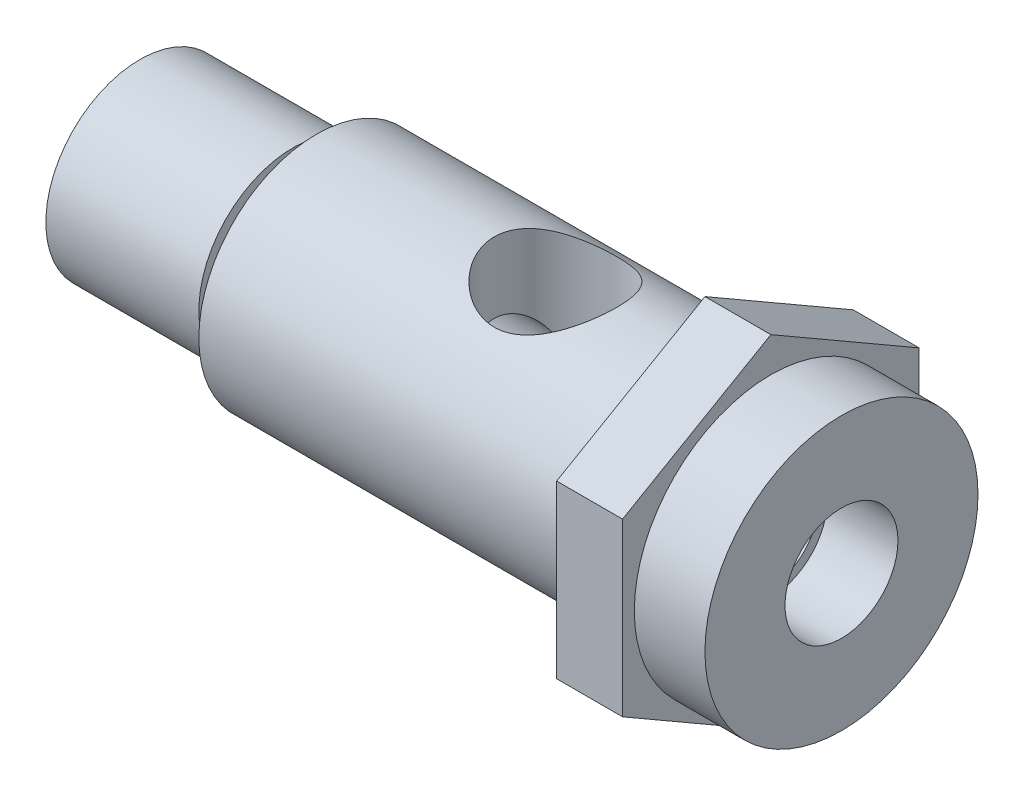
ISO-10303-21;
HEADER;
FILE_DESCRIPTION(('STEP AP214'),'2;1');
FILE_NAME('part.step','',(''),(''),'','','');
FILE_SCHEMA(('AUTOMOTIVE_DESIGN { 1 0 10303 214 1 1 1 1 }'));
ENDSEC;
DATA;
#1=APPLICATION_CONTEXT('core data for automotive mechanical design processes');
#2=APPLICATION_PROTOCOL_DEFINITION('international standard','automotive_design',2000,#1);
#3=PRODUCT_CONTEXT('',#1,'mechanical');
#4=PRODUCT('Part','Part','',(#3));
#5=PRODUCT_RELATED_PRODUCT_CATEGORY('part','',(#4));
#6=PRODUCT_DEFINITION_FORMATION('','',#4);
#7=PRODUCT_DEFINITION_CONTEXT('part definition',#1,'design');
#8=PRODUCT_DEFINITION('design','',#6,#7);
#9=PRODUCT_DEFINITION_SHAPE('','',#8);
#10=(LENGTH_UNIT() NAMED_UNIT(*) SI_UNIT(.MILLI.,.METRE.));
#11=(NAMED_UNIT(*) PLANE_ANGLE_UNIT() SI_UNIT($,.RADIAN.));
#12=(NAMED_UNIT(*) SI_UNIT($,.STERADIAN.) SOLID_ANGLE_UNIT());
#13=UNCERTAINTY_MEASURE_WITH_UNIT(LENGTH_MEASURE(1.E-05),#10,'distance_accuracy_value','');
#14=(GEOMETRIC_REPRESENTATION_CONTEXT(3) GLOBAL_UNCERTAINTY_ASSIGNED_CONTEXT((#13)) GLOBAL_UNIT_ASSIGNED_CONTEXT((#10,
#11,#12)) REPRESENTATION_CONTEXT('',''));
#15=CARTESIAN_POINT('',(0.,0.,0.));
#16=DIRECTION('',(0.,0.,1.));
#17=DIRECTION('',(1.,0.,0.));
#18=AXIS2_PLACEMENT_3D('',#15,#16,#17);
#19=CARTESIAN_POINT('',(18.923,0.6696363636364,0.));
#20=DIRECTION('',(1.,0.,0.));
#21=DIRECTION('',(0.,0.,-1.));
#22=AXIS2_PLACEMENT_3D('',#19,#20,#21);
#23=PLANE('',#22);
#24=CARTESIAN_POINT('',(18.9229999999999,0.,0.));
#25=DIRECTION('',(1.,0.,0.));
#26=DIRECTION('',(0.,0.,-1.));
#27=AXIS2_PLACEMENT_3D('',#24,#25,#26);
#28=CIRCLE('',#27,3.048);
#29=CARTESIAN_POINT('',(18.9229999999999,0.,-3.04800000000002));
#30=VERTEX_POINT('',#29);
#31=EDGE_CURVE('E422',#30,#30,#28,.F.);
#32=ORIENTED_EDGE('',*,*,#31,.T.);
#33=EDGE_LOOP('',(#32));
#34=FACE_BOUND('',#33,.T.);
#35=CARTESIAN_POINT('',(18.9229999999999,0.,0.));
#36=DIRECTION('',(1.,0.,0.));
#37=DIRECTION('',(0.,0.,-1.));
#38=AXIS2_PLACEMENT_3D('',#35,#36,#37);
#39=CIRCLE('',#38,7.366);
#40=CARTESIAN_POINT('',(18.9229999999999,0.,-7.36600000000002));
#41=VERTEX_POINT('',#40);
#42=EDGE_CURVE('E22',#41,#41,#39,.F.);
#43=ORIENTED_EDGE('',*,*,#42,.F.);
#44=EDGE_LOOP('',(#43));
#45=FACE_BOUND('',#44,.T.);
#46=ADVANCED_FACE('F17',(#34,#45),#23,.T.);
#47=CARTESIAN_POINT('',(-18.923,0.461818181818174,0.));
#48=DIRECTION('',(1.,0.,0.));
#49=DIRECTION('',(0.,0.,-1.));
#50=AXIS2_PLACEMENT_3D('',#47,#48,#49);
#51=PLANE('',#50);
#52=CARTESIAN_POINT('',(-18.923,0.,0.));
#53=DIRECTION('',(1.,0.,0.));
#54=DIRECTION('',(0.,0.,-1.));
#55=AXIS2_PLACEMENT_3D('',#52,#53,#54);
#56=CIRCLE('',#55,3.048);
#57=CARTESIAN_POINT('',(-18.923,0.,-3.04800000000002));
#58=VERTEX_POINT('',#57);
#59=EDGE_CURVE('E425',#58,#58,#56,.T.);
#60=ORIENTED_EDGE('',*,*,#59,.T.);
#61=EDGE_LOOP('',(#60));
#62=FACE_BOUND('',#61,.T.);
#63=CARTESIAN_POINT('',(-18.923,0.,0.));
#64=DIRECTION('',(1.,0.,0.));
#65=DIRECTION('',(0.,0.,-1.));
#66=AXIS2_PLACEMENT_3D('',#63,#64,#65);
#67=CIRCLE('',#66,5.08);
#68=CARTESIAN_POINT('',(-18.923,0.,-5.08000000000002));
#69=VERTEX_POINT('',#68);
#70=EDGE_CURVE('E428',#69,#69,#67,.T.);
#71=ORIENTED_EDGE('',*,*,#70,.F.);
#72=EDGE_LOOP('',(#71));
#73=FACE_BOUND('',#72,.T.);
#74=ADVANCED_FACE('F387',(#62,#73),#51,.F.);
#75=CARTESIAN_POINT('',(15.113,0.,0.));
#76=DIRECTION('',(1.,0.,0.));
#77=DIRECTION('',(0.,0.,-1.));
#78=AXIS2_PLACEMENT_3D('',#75,#76,#77);
#79=CYLINDRICAL_SURFACE('',#78,7.366);
#80=ORIENTED_EDGE('',*,*,#42,.T.);
#81=EDGE_LOOP('',(#80));
#82=FACE_BOUND('',#81,.T.);
#83=CARTESIAN_POINT('',(15.113,0.,0.));
#84=DIRECTION('',(1.,0.,0.));
#85=DIRECTION('',(0.,0.,-1.));
#86=AXIS2_PLACEMENT_3D('',#83,#84,#85);
#87=CIRCLE('',#86,7.366);
#88=CARTESIAN_POINT('',(15.113,0.,-7.36600000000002));
#89=VERTEX_POINT('',#88);
#90=EDGE_CURVE('E433',#89,#89,#87,.F.);
#91=ORIENTED_EDGE('',*,*,#90,.F.);
#92=EDGE_LOOP('',(#91));
#93=FACE_BOUND('',#92,.T.);
#94=ADVANCED_FACE('F378',(#82,#93),#79,.T.);
#95=CARTESIAN_POINT('',(-18.923,0.,0.));
#96=DIRECTION('',(1.,0.,0.));
#97=DIRECTION('',(0.,0.,-1.));
#98=AXIS2_PLACEMENT_3D('',#95,#96,#97);
#99=CYLINDRICAL_SURFACE('',#98,3.048);
#100=ORIENTED_EDGE('',*,*,#59,.F.);
#101=EDGE_LOOP('',(#100));
#102=FACE_BOUND('',#101,.T.);
#103=CARTESIAN_POINT('',(-16.383,0.,0.));
#104=DIRECTION('',(1.,0.,0.));
#105=DIRECTION('',(0.,0.,-1.));
#106=AXIS2_PLACEMENT_3D('',#103,#104,#105);
#107=CIRCLE('',#106,3.048);
#108=CARTESIAN_POINT('',(-16.383,0.,-3.04800000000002));
#109=VERTEX_POINT('',#108);
#110=EDGE_CURVE('E436',#109,#109,#107,.T.);
#111=ORIENTED_EDGE('',*,*,#110,.T.);
#112=EDGE_LOOP('',(#111));
#113=FACE_BOUND('',#112,.T.);
#114=ADVANCED_FACE('F369',(#102,#113),#99,.F.);
#115=CARTESIAN_POINT('',(15.113,0.,0.));
#116=DIRECTION('',(1.,0.,0.));
#117=DIRECTION('',(0.,0.,-1.));
#118=AXIS2_PLACEMENT_3D('',#115,#116,#117);
#119=CYLINDRICAL_SURFACE('',#118,3.048);
#120=CARTESIAN_POINT('',(15.113,0.,0.));
#121=DIRECTION('',(1.,0.,0.));
#122=DIRECTION('',(0.,0.,-1.));
#123=AXIS2_PLACEMENT_3D('',#120,#121,#122);
#124=CIRCLE('',#123,3.048);
#125=CARTESIAN_POINT('',(15.113,0.,-3.04800000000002));
#126=VERTEX_POINT('',#125);
#127=EDGE_CURVE('E439',#126,#126,#124,.T.);
#128=ORIENTED_EDGE('',*,*,#127,.F.);
#129=EDGE_LOOP('',(#128));
#130=FACE_BOUND('',#129,.T.);
#131=ORIENTED_EDGE('',*,*,#31,.F.);
#132=EDGE_LOOP('',(#131));
#133=FACE_BOUND('',#132,.T.);
#134=ADVANCED_FACE('F360',(#130,#133),#119,.F.);
#135=CARTESIAN_POINT('',(-18.923,0.,0.));
#136=DIRECTION('',(1.,0.,0.));
#137=DIRECTION('',(0.,0.,-1.));
#138=AXIS2_PLACEMENT_3D('',#135,#136,#137);
#139=CYLINDRICAL_SURFACE('',#138,5.08);
#140=ORIENTED_EDGE('',*,*,#70,.T.);
#141=EDGE_LOOP('',(#140));
#142=FACE_BOUND('',#141,.T.);
#143=CARTESIAN_POINT('',(-10.668,0.,0.));
#144=DIRECTION('',(1.,0.,0.));
#145=DIRECTION('',(0.,0.,-1.));
#146=AXIS2_PLACEMENT_3D('',#143,#144,#145);
#147=CIRCLE('',#146,5.08);
#148=CARTESIAN_POINT('',(-10.668,0.,-5.08000000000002));
#149=VERTEX_POINT('',#148);
#150=EDGE_CURVE('E109',#149,#149,#147,.T.);
#151=ORIENTED_EDGE('',*,*,#150,.F.);
#152=EDGE_LOOP('',(#151));
#153=FACE_BOUND('',#152,.T.);
#154=ADVANCED_FACE('F351',(#142,#153),#139,.T.);
#155=CARTESIAN_POINT('',(15.113,0.,0.));
#156=DIRECTION('',(1.,0.,0.));
#157=DIRECTION('',(0.,0.,-1.));
#158=AXIS2_PLACEMENT_3D('',#155,#156,#157);
#159=PLANE('',#158);
#160=ORIENTED_EDGE('',*,*,#90,.T.);
#161=EDGE_LOOP('',(#160));
#162=FACE_BOUND('',#161,.T.);
#163=DIRECTION('',(0.,-0.499999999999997,0.86602540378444));
#164=VECTOR('',#163,1.);
#165=CARTESIAN_POINT('',(15.113,9.23875900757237,0.));
#166=LINE('',#165,#164);
#167=CARTESIAN_POINT('',(15.113,4.61937950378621,8.00100000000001));
#168=VERTEX_POINT('',#167);
#169=CARTESIAN_POINT('',(15.113,9.23875900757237,0.));
#170=VERTEX_POINT('',#169);
#171=EDGE_CURVE('E118',#168,#170,#166,.F.);
#172=ORIENTED_EDGE('',*,*,#171,.F.);
#173=DIRECTION('',(0.,1.,0.));
#174=VECTOR('',#173,1.);
#175=CARTESIAN_POINT('',(15.113,4.61937950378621,8.00100000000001));
#176=LINE('',#175,#174);
#177=CARTESIAN_POINT('',(15.113,-4.61937950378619,8.00100000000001));
#178=VERTEX_POINT('',#177);
#179=EDGE_CURVE('E127',#178,#168,#176,.T.);
#180=ORIENTED_EDGE('',*,*,#179,.F.);
#181=DIRECTION('',(0.,-0.499999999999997,-0.86602540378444));
#182=VECTOR('',#181,1.);
#183=CARTESIAN_POINT('',(15.113,-4.61937950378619,8.00100000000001));
#184=LINE('',#183,#182);
#185=CARTESIAN_POINT('',(15.113,-9.23875900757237,0.));
#186=VERTEX_POINT('',#185);
#187=EDGE_CURVE('E89',#186,#178,#184,.F.);
#188=ORIENTED_EDGE('',*,*,#187,.F.);
#189=DIRECTION('',(0.,0.499999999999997,-0.86602540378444));
#190=VECTOR('',#189,1.);
#191=CARTESIAN_POINT('',(15.113,-9.23875900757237,0.));
#192=LINE('',#191,#190);
#193=CARTESIAN_POINT('',(15.113,-4.61937950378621,-8.00100000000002));
#194=VERTEX_POINT('',#193);
#195=EDGE_CURVE('E108',#194,#186,#192,.F.);
#196=ORIENTED_EDGE('',*,*,#195,.F.);
#197=DIRECTION('',(0.,1.,0.));
#198=VECTOR('',#197,1.);
#199=CARTESIAN_POINT('',(15.113,-4.61937950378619,-8.001));
#200=LINE('',#199,#198);
#201=CARTESIAN_POINT('',(15.113,4.61937950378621,-8.00100000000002));
#202=VERTEX_POINT('',#201);
#203=EDGE_CURVE('E101',#202,#194,#200,.F.);
#204=ORIENTED_EDGE('',*,*,#203,.F.);
#205=DIRECTION('',(0.,0.499999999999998,0.86602540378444));
#206=VECTOR('',#205,1.);
#207=CARTESIAN_POINT('',(15.113,4.61937950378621,-8.00100000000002));
#208=LINE('',#207,#206);
#209=EDGE_CURVE('E105',#170,#202,#208,.F.);
#210=ORIENTED_EDGE('',*,*,#209,.F.);
#211=EDGE_LOOP('',(#172,#180,#188,#196,#204,#210));
#212=FACE_BOUND('',#211,.T.);
#213=ADVANCED_FACE('F103',(#162,#212),#159,.T.);
#214=CARTESIAN_POINT('',(-16.383,0.277090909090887,0.));
#215=DIRECTION('',(1.,0.,0.));
#216=DIRECTION('',(0.,0.,-1.));
#217=AXIS2_PLACEMENT_3D('',#214,#215,#216);
#218=PLANE('',#217);
#219=CARTESIAN_POINT('',(-16.383,0.,0.));
#220=DIRECTION('',(1.,0.,0.));
#221=DIRECTION('',(0.,0.,-1.));
#222=AXIS2_PLACEMENT_3D('',#219,#220,#221);
#223=CIRCLE('',#222,2.54);
#224=CARTESIAN_POINT('',(-16.383,0.,-2.54000000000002));
#225=VERTEX_POINT('',#224);
#226=EDGE_CURVE('E160',#225,#225,#223,.T.);
#227=ORIENTED_EDGE('',*,*,#226,.T.);
#228=EDGE_LOOP('',(#227));
#229=FACE_BOUND('',#228,.T.);
#230=ORIENTED_EDGE('',*,*,#110,.F.);
#231=EDGE_LOOP('',(#230));
#232=FACE_BOUND('',#231,.T.);
#233=ADVANCED_FACE('F334',(#229,#232),#218,.F.);
#234=CARTESIAN_POINT('',(15.113,0.,0.));
#235=DIRECTION('',(1.,0.,0.));
#236=DIRECTION('',(0.,0.,-1.));
#237=AXIS2_PLACEMENT_3D('',#234,#235,#236);
#238=PLANE('',#237);
#239=CARTESIAN_POINT('',(15.113,0.,0.));
#240=DIRECTION('',(1.,0.,0.));
#241=DIRECTION('',(0.,0.,-1.));
#242=AXIS2_PLACEMENT_3D('',#239,#240,#241);
#243=CIRCLE('',#242,2.54);
#244=CARTESIAN_POINT('',(15.113,0.,-2.54000000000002));
#245=VERTEX_POINT('',#244);
#246=EDGE_CURVE('E145',#245,#245,#243,.F.);
#247=ORIENTED_EDGE('',*,*,#246,.T.);
#248=EDGE_LOOP('',(#247));
#249=FACE_BOUND('',#248,.T.);
#250=ORIENTED_EDGE('',*,*,#127,.T.);
#251=EDGE_LOOP('',(#250));
#252=FACE_BOUND('',#251,.T.);
#253=ADVANCED_FACE('F325',(#249,#252),#238,.T.);
#254=CARTESIAN_POINT('',(-10.668,0.461818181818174,0.));
#255=DIRECTION('',(1.,0.,0.));
#256=DIRECTION('',(0.,0.,-1.));
#257=AXIS2_PLACEMENT_3D('',#254,#255,#256);
#258=PLANE('',#257);
#259=CARTESIAN_POINT('',(-10.6679999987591,0.,0.));
#260=DIRECTION('',(1.,0.,0.));
#261=DIRECTION('',(0.,0.,-1.));
#262=AXIS2_PLACEMENT_3D('',#259,#260,#261);
#263=CIRCLE('',#262,4.23333333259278);
#264=CARTESIAN_POINT('',(-10.6679999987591,0.,-4.2333333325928));
#265=VERTEX_POINT('',#264);
#266=EDGE_CURVE('E144',#265,#265,#263,.T.);
#267=ORIENTED_EDGE('',*,*,#266,.F.);
#268=EDGE_LOOP('',(#267));
#269=FACE_BOUND('',#268,.T.);
#270=ORIENTED_EDGE('',*,*,#150,.T.);
#271=EDGE_LOOP('',(#270));
#272=FACE_BOUND('',#271,.T.);
#273=ADVANCED_FACE('F318',(#269,#272),#258,.T.);
#274=CARTESIAN_POINT('',(15.113,-4.61937950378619,-8.001));
#275=DIRECTION('',(0.,0.,-1.));
#276=DIRECTION('',(-1.,0.,0.));
#277=AXIS2_PLACEMENT_3D('',#274,#275,#276);
#278=PLANE('',#277);
#279=ORIENTED_EDGE('',*,*,#203,.T.);
#280=DIRECTION('',(1.,0.,0.));
#281=VECTOR('',#280,1.);
#282=CARTESIAN_POINT('',(15.113,-4.61937950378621,-8.00100000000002));
#283=LINE('',#282,#281);
#284=CARTESIAN_POINT('',(11.557,-4.61937950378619,-8.001));
#285=VERTEX_POINT('',#284);
#286=EDGE_CURVE('E82',#285,#194,#283,.T.);
#287=ORIENTED_EDGE('',*,*,#286,.F.);
#288=DIRECTION('',(0.,1.,0.));
#289=VECTOR('',#288,1.);
#290=CARTESIAN_POINT('',(11.557,0.,-8.001));
#291=LINE('',#290,#289);
#292=CARTESIAN_POINT('',(11.557,4.61937950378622,-8.001));
#293=VERTEX_POINT('',#292);
#294=EDGE_CURVE('E115',#285,#293,#291,.T.);
#295=ORIENTED_EDGE('',*,*,#294,.T.);
#296=DIRECTION('',(1.,0.,0.));
#297=VECTOR('',#296,1.);
#298=CARTESIAN_POINT('',(15.113,4.61937950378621,-8.00100000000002));
#299=LINE('',#298,#297);
#300=EDGE_CURVE('E112',#202,#293,#299,.F.);
#301=ORIENTED_EDGE('',*,*,#300,.F.);
#302=EDGE_LOOP('',(#279,#287,#295,#301));
#303=FACE_BOUND('',#302,.T.);
#304=ADVANCED_FACE('F113',(#303),#278,.T.);
#305=CARTESIAN_POINT('',(15.113,4.61937950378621,-8.00100000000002));
#306=DIRECTION('',(0.,0.86602540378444,-0.499999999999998));
#307=DIRECTION('',(0.,0.499999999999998,0.86602540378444));
#308=AXIS2_PLACEMENT_3D('',#305,#306,#307);
#309=PLANE('',#308);
#310=ORIENTED_EDGE('',*,*,#209,.T.);
#311=ORIENTED_EDGE('',*,*,#300,.T.);
#312=DIRECTION('',(0.,0.499999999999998,0.86602540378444));
#313=VECTOR('',#312,1.);
#314=CARTESIAN_POINT('',(11.557,4.61937950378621,-8.00100000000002));
#315=LINE('',#314,#313);
#316=CARTESIAN_POINT('',(11.557,9.23875900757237,0.));
#317=VERTEX_POINT('',#316);
#318=EDGE_CURVE('E153',#293,#317,#315,.T.);
#319=ORIENTED_EDGE('',*,*,#318,.T.);
#320=DIRECTION('',(1.,0.,0.));
#321=VECTOR('',#320,1.);
#322=CARTESIAN_POINT('',(15.113,9.23875900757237,0.));
#323=LINE('',#322,#321);
#324=EDGE_CURVE('E122',#170,#317,#323,.F.);
#325=ORIENTED_EDGE('',*,*,#324,.F.);
#326=EDGE_LOOP('',(#310,#311,#319,#325));
#327=FACE_BOUND('',#326,.T.);
#328=ADVANCED_FACE('F120',(#327),#309,.T.);
#329=CARTESIAN_POINT('',(15.113,9.23875900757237,0.));
#330=DIRECTION('',(0.,0.86602540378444,0.499999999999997));
#331=DIRECTION('',(0.,-0.499999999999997,0.86602540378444));
#332=AXIS2_PLACEMENT_3D('',#329,#330,#331);
#333=PLANE('',#332);
#334=ORIENTED_EDGE('',*,*,#171,.T.);
#335=ORIENTED_EDGE('',*,*,#324,.T.);
#336=DIRECTION('',(0.,-0.499999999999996,0.866025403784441));
#337=VECTOR('',#336,1.);
#338=CARTESIAN_POINT('',(11.557,9.23875900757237,0.));
#339=LINE('',#338,#337);
#340=CARTESIAN_POINT('',(11.557,4.61937950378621,8.00100000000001));
#341=VERTEX_POINT('',#340);
#342=EDGE_CURVE('E151',#317,#341,#339,.T.);
#343=ORIENTED_EDGE('',*,*,#342,.T.);
#344=DIRECTION('',(1.,0.,0.));
#345=VECTOR('',#344,1.);
#346=CARTESIAN_POINT('',(15.113,4.61937950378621,8.00100000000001));
#347=LINE('',#346,#345);
#348=EDGE_CURVE('E129',#168,#341,#347,.F.);
#349=ORIENTED_EDGE('',*,*,#348,.F.);
#350=EDGE_LOOP('',(#334,#335,#343,#349));
#351=FACE_BOUND('',#350,.T.);
#352=ADVANCED_FACE('F229',(#351),#333,.T.);
#353=CARTESIAN_POINT('',(15.113,4.61937950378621,8.00100000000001));
#354=DIRECTION('',(0.,0.,1.));
#355=DIRECTION('',(1.,0.,0.));
#356=AXIS2_PLACEMENT_3D('',#353,#354,#355);
#357=PLANE('',#356);
#358=ORIENTED_EDGE('',*,*,#179,.T.);
#359=ORIENTED_EDGE('',*,*,#348,.T.);
#360=DIRECTION('',(0.,1.,0.));
#361=VECTOR('',#360,1.);
#362=CARTESIAN_POINT('',(11.557,0.,8.00100000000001));
#363=LINE('',#362,#361);
#364=CARTESIAN_POINT('',(11.557,-4.61937950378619,8.00100000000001));
#365=VERTEX_POINT('',#364);
#366=EDGE_CURVE('E149',#341,#365,#363,.F.);
#367=ORIENTED_EDGE('',*,*,#366,.T.);
#368=DIRECTION('',(1.,0.,0.));
#369=VECTOR('',#368,1.);
#370=CARTESIAN_POINT('',(15.113,-4.61937950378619,8.00100000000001));
#371=LINE('',#370,#369);
#372=EDGE_CURVE('E134',#178,#365,#371,.F.);
#373=ORIENTED_EDGE('',*,*,#372,.F.);
#374=EDGE_LOOP('',(#358,#359,#367,#373));
#375=FACE_BOUND('',#374,.T.);
#376=ADVANCED_FACE('F226',(#375),#357,.T.);
#377=CARTESIAN_POINT('',(15.113,-4.61937950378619,8.00100000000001));
#378=DIRECTION('',(0.,-0.86602540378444,0.499999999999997));
#379=DIRECTION('',(0.,-0.499999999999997,-0.86602540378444));
#380=AXIS2_PLACEMENT_3D('',#377,#378,#379);
#381=PLANE('',#380);
#382=ORIENTED_EDGE('',*,*,#187,.T.);
#383=ORIENTED_EDGE('',*,*,#372,.T.);
#384=DIRECTION('',(0.,-0.499999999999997,-0.86602540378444));
#385=VECTOR('',#384,1.);
#386=CARTESIAN_POINT('',(11.557,-4.61937950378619,8.00100000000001));
#387=LINE('',#386,#385);
#388=CARTESIAN_POINT('',(11.557,-9.23875900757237,0.));
#389=VERTEX_POINT('',#388);
#390=EDGE_CURVE('E62',#365,#389,#387,.T.);
#391=ORIENTED_EDGE('',*,*,#390,.T.);
#392=DIRECTION('',(1.,0.,0.));
#393=VECTOR('',#392,1.);
#394=CARTESIAN_POINT('',(15.113,-9.23875900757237,0.));
#395=LINE('',#394,#393);
#396=EDGE_CURVE('E137',#186,#389,#395,.F.);
#397=ORIENTED_EDGE('',*,*,#396,.F.);
#398=EDGE_LOOP('',(#382,#383,#391,#397));
#399=FACE_BOUND('',#398,.T.);
#400=ADVANCED_FACE('F223',(#399),#381,.T.);
#401=CARTESIAN_POINT('',(15.113,-9.23875900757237,0.));
#402=DIRECTION('',(0.,-0.86602540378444,-0.499999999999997));
#403=DIRECTION('',(0.,0.499999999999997,-0.86602540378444));
#404=AXIS2_PLACEMENT_3D('',#401,#402,#403);
#405=PLANE('',#404);
#406=ORIENTED_EDGE('',*,*,#195,.T.);
#407=ORIENTED_EDGE('',*,*,#396,.T.);
#408=DIRECTION('',(0.,0.5,-0.866025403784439));
#409=VECTOR('',#408,1.);
#410=CARTESIAN_POINT('',(11.557,-9.23875900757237,0.));
#411=LINE('',#410,#409);
#412=EDGE_CURVE('E146',#389,#285,#411,.T.);
#413=ORIENTED_EDGE('',*,*,#412,.T.);
#414=ORIENTED_EDGE('',*,*,#286,.T.);
#415=EDGE_LOOP('',(#406,#407,#413,#414));
#416=FACE_BOUND('',#415,.T.);
#417=ADVANCED_FACE('F222',(#416),#405,.T.);
#418=CARTESIAN_POINT('',(3.49250000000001,-1.12712499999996,-0.300181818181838));
#419=DIRECTION('',(0.,1.,0.));
#420=DIRECTION('',(0.,0.,1.));
#421=AXIS2_PLACEMENT_3D('',#418,#419,#420);
#422=PLANE('',#421);
#423=DIRECTION('',(1.,0.,0.));
#424=VECTOR('',#423,1.);
#425=CARTESIAN_POINT('',(-16.383,-1.12712499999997,-2.2762225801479));
#426=LINE('',#425,#424);
#427=CARTESIAN_POINT('',(1.10042668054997,-1.12712499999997,-2.2762225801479));
#428=VERTEX_POINT('',#427);
#429=CARTESIAN_POINT('',(5.88457331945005,-1.12712499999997,-2.27622258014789));
#430=VERTEX_POINT('',#429);
#431=EDGE_CURVE('E139',#428,#430,#426,.T.);
#432=ORIENTED_EDGE('',*,*,#431,.T.);
#433=CARTESIAN_POINT('',(3.49250000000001,-1.12712499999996,0.));
#434=DIRECTION('',(0.,-1.,0.));
#435=DIRECTION('',(0.,0.,-1.));
#436=AXIS2_PLACEMENT_3D('',#433,#434,#435);
#437=CIRCLE('',#436,3.302);
#438=EDGE_CURVE('E48',#430,#428,#437,.F.);
#439=ORIENTED_EDGE('',*,*,#438,.T.);
#440=EDGE_LOOP('',(#432,#439));
#441=FACE_BOUND('',#440,.T.);
#442=ADVANCED_FACE('F192',(#441),#422,.T.);
#443=CARTESIAN_POINT('',(-16.383,0.,0.));
#444=DIRECTION('',(1.,0.,0.));
#445=DIRECTION('',(0.,0.,-1.));
#446=AXIS2_PLACEMENT_3D('',#443,#444,#445);
#447=CYLINDRICAL_SURFACE('',#446,2.54);
#448=ORIENTED_EDGE('',*,*,#226,.F.);
#449=EDGE_LOOP('',(#448));
#450=FACE_BOUND('',#449,.T.);
#451=ORIENTED_EDGE('',*,*,#246,.F.);
#452=EDGE_LOOP('',(#451));
#453=FACE_BOUND('',#452,.T.);
#454=ORIENTED_EDGE('',*,*,#431,.F.);
#455=CARTESIAN_POINT('',(1.10042668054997,-1.12712499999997,-2.27622258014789));
#456=CARTESIAN_POINT('',(1.14316227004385,-1.03636922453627,-2.32118688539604));
#457=CARTESIAN_POINT('',(1.18384572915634,-0.941590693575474,-2.36133058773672));
#458=CARTESIAN_POINT('',(1.25722555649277,-0.743898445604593,-2.43090556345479));
#459=CARTESIAN_POINT('',(1.28982127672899,-0.640901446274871,-2.4602038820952));
#460=CARTESIAN_POINT('',(1.3290357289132,-0.481318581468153,-2.49458144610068));
#461=CARTESIAN_POINT('',(1.34052892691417,-0.426972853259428,-2.50447230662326));
#462=CARTESIAN_POINT('',(1.3596072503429,-0.3170983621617,-2.52073993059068));
#463=CARTESIAN_POINT('',(1.36719448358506,-0.261570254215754,-2.52711858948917));
#464=CARTESIAN_POINT('',(1.37800530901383,-0.150121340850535,-2.53617186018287));
#465=CARTESIAN_POINT('',(1.38125493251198,-0.0942049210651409,-2.53886857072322));
#466=CARTESIAN_POINT('',(1.38328752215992,0.0177465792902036,-2.54055601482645));
#467=CARTESIAN_POINT('',(1.38207111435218,0.0737816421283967,-2.53954726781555));
#468=CARTESIAN_POINT('',(1.37278336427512,0.224918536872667,-2.53181487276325));
#469=CARTESIAN_POINT('',(1.36047227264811,0.319621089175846,-2.52155389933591));
#470=CARTESIAN_POINT('',(1.32486559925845,0.505411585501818,-2.49100247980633));
#471=CARTESIAN_POINT('',(1.30153458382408,0.596486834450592,-2.47067967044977));
#472=CARTESIAN_POINT('',(1.23430694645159,0.814225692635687,-2.40969661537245));
#473=CARTESIAN_POINT('',(1.18588578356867,0.938055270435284,-2.36398377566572));
#474=CARTESIAN_POINT('',(1.08023807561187,1.17414173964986,-2.25608375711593));
#475=CARTESIAN_POINT('',(1.0229966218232,1.28637848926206,-2.19386855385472));
#476=CARTESIAN_POINT('',(0.903221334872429,1.50375964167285,-2.05131176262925));
#477=CARTESIAN_POINT('',(0.840566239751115,1.60840966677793,-1.97031977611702));
#478=CARTESIAN_POINT('',(0.717259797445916,1.80447785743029,-1.79247157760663));
#479=CARTESIAN_POINT('',(0.656607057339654,1.89590537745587,-1.69562668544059));
#480=CARTESIAN_POINT('',(0.543684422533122,2.0609169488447,-1.49027688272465));
#481=CARTESIAN_POINT('',(0.491189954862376,2.13502880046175,-1.38232376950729));
#482=CARTESIAN_POINT('',(0.39585083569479,2.26709460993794,-1.15296902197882));
#483=CARTESIAN_POINT('',(0.353000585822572,2.3250579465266,-1.03157525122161));
#484=CARTESIAN_POINT('',(0.28630603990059,2.4142918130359,-0.797470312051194));
#485=CARTESIAN_POINT('',(0.260539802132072,2.44831554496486,-0.686357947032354));
#486=CARTESIAN_POINT('',(0.22048622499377,2.50095322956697,-0.458691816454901));
#487=CARTESIAN_POINT('',(0.206168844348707,2.51960751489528,-0.342153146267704));
#488=CARTESIAN_POINT('',(0.195603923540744,2.53336168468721,-0.18732509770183));
#489=CARTESIAN_POINT('',(0.193693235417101,2.53584765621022,-0.149936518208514));
#490=CARTESIAN_POINT('',(0.191139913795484,2.53916825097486,-0.0750380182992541));
#491=CARTESIAN_POINT('',(0.190497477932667,2.54000261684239,-0.0375280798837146));
#492=CARTESIAN_POINT('',(0.190508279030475,2.53999140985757,0.123191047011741));
#493=CARTESIAN_POINT('',(0.197466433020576,2.53096374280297,0.246577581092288));
#494=CARTESIAN_POINT('',(0.224677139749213,2.49543342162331,0.489446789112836));
#495=CARTESIAN_POINT('',(0.244962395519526,2.46888777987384,0.608919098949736));
#496=CARTESIAN_POINT('',(0.29689303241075,2.40016715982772,0.839771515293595));
#497=CARTESIAN_POINT('',(0.328468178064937,2.35808876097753,0.951196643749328));
#498=CARTESIAN_POINT('',(0.400637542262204,2.26033058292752,1.16460172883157));
#499=CARTESIAN_POINT('',(0.44122926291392,2.20465457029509,1.26658429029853));
#500=CARTESIAN_POINT('',(0.533053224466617,2.07580422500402,1.46914042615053));
#501=CARTESIAN_POINT('',(0.584926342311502,2.00147855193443,1.56868495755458));
#502=CARTESIAN_POINT('',(0.693239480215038,1.8405964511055,1.75469581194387));
#503=CARTESIAN_POINT('',(0.749686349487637,1.75402152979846,1.84114194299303));
#504=CARTESIAN_POINT('',(0.875839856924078,1.55018921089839,2.01752128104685));
#505=CARTESIAN_POINT('',(0.94580711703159,1.43032585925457,2.10426670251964));
#506=CARTESIAN_POINT('',(1.07998073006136,1.17493211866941,2.25681469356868));
#507=CARTESIAN_POINT('',(1.14419333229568,1.03941909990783,2.3226401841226));
#508=CARTESIAN_POINT('',(1.23665292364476,0.802855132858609,2.41183780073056));
#509=CARTESIAN_POINT('',(1.26963743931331,0.706236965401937,2.44201115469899));
#510=CARTESIAN_POINT('',(1.32457949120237,0.507254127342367,2.49092305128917));
#511=CARTESIAN_POINT('',(1.34657465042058,0.404910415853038,2.5097006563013));
#512=CARTESIAN_POINT('',(1.36828377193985,0.251249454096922,2.52803969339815));
#513=CARTESIAN_POINT('',(1.3736342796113,0.201255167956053,2.53251484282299));
#514=CARTESIAN_POINT('',(1.38080086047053,0.100842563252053,2.53849461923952));
#515=CARTESIAN_POINT('',(1.38261817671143,0.0504244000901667,2.54000029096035));
#516=CARTESIAN_POINT('',(1.38261682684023,-0.0562750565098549,2.5399996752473));
#517=CARTESIAN_POINT('',(1.38035138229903,-0.112557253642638,2.53812328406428));
#518=CARTESIAN_POINT('',(1.37144054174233,-0.224540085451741,2.53067986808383));
#519=CARTESIAN_POINT('',(1.36479241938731,-0.280240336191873,2.52511054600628));
#520=CARTESIAN_POINT('',(1.33870769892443,-0.446248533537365,2.50298326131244));
#521=CARTESIAN_POINT('',(1.31313598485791,-0.554936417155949,2.48100783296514));
#522=CARTESIAN_POINT('',(1.2570826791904,-0.742859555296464,2.43047050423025));
#523=CARTESIAN_POINT('',(1.22878249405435,-0.823463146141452,2.4042837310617));
#524=CARTESIAN_POINT('',(1.16755067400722,-0.979159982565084,2.34513223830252));
#525=CARTESIAN_POINT('',(1.1346747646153,-1.05430504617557,2.3122471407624));
#526=CARTESIAN_POINT('',(1.10042668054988,-1.12712499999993,2.27622258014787));
#527=B_SPLINE_CURVE_WITH_KNOTS('',3,(#455,#456,#457,#458,#459,#460,#461,#462,#463,#464,#465,
#466,#467,#468,#469,#470,#471,#472,#473,#474,#475,#476,#477,#478,#479,#480,#481,#482,#483,#484,
#485,#486,#487,#488,#489,#490,#491,#492,#493,#494,#495,#496,#497,#498,#499,#500,#501,#502,#503,
#504,#505,#506,#507,#508,#509,#510,#511,#512,#513,#514,#515,#516,#517,#518,#519,#520,#521,#522,
#523,#524,#525,#526),.UNSPECIFIED.,.F.,.F.,(4,2,2,2,2,2,2,2,2,2,2,2,2,2,2,2,2,2,2,2,2,2,2,2,2,2,
2,2,2,2,2,2,2,2,2,4),(0.,0.330515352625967,0.664957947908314,0.833991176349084,1.00293309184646,
1.17085650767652,1.33875638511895,1.6254049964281,1.91298164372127,2.33244368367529,
2.75262266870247,3.19041134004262,3.62788875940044,4.04946405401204,4.47079399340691,
4.82641016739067,5.1810901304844,5.29360671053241,5.40614082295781,5.77554941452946,
6.14586789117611,6.51392155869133,6.88187338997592,7.28433180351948,7.68740445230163,
8.17643497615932,8.66492783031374,8.98330760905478,9.30058978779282,9.45184378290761,
9.60304455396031,9.77180513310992,9.94067079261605,10.279956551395,10.5475030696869,
10.8120376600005),.UNSPECIFIED.);
#528=CARTESIAN_POINT('',(1.10042668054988,-1.12712499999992,2.27622258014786));
#529=VERTEX_POINT('',#528);
#530=EDGE_CURVE('E37',#428,#529,#527,.T.);
#531=ORIENTED_EDGE('',*,*,#530,.T.);
#532=DIRECTION('',(1.,0.,0.));
#533=VECTOR('',#532,1.);
#534=CARTESIAN_POINT('',(3.49250000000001,-1.12712499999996,2.27622258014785));
#535=LINE('',#534,#533);
#536=CARTESIAN_POINT('',(5.88457331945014,-1.12712499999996,2.27622258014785));
#537=VERTEX_POINT('',#536);
#538=EDGE_CURVE('E142',#537,#529,#535,.F.);
#539=ORIENTED_EDGE('',*,*,#538,.F.);
#540=CARTESIAN_POINT('',(5.88457331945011,-1.12712499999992,2.27622258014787));
#541=CARTESIAN_POINT('',(5.84077958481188,-1.03409515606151,2.3223040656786));
#542=CARTESIAN_POINT('',(5.79913658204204,-0.936871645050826,2.36332205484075));
#543=CARTESIAN_POINT('',(5.72445940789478,-0.734187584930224,2.4339648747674));
#544=CARTESIAN_POINT('',(5.69150876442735,-0.628658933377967,2.46348037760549));
#545=CARTESIAN_POINT('',(5.64538389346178,-0.435831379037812,2.50380232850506));
#546=CARTESIAN_POINT('',(5.62942384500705,-0.349798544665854,2.5173287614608));
#547=CARTESIAN_POINT('',(5.60795105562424,-0.175821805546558,2.53540550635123));
#548=CARTESIAN_POINT('',(5.60239190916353,-0.0878881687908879,2.53999569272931));
#549=CARTESIAN_POINT('',(5.60237616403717,0.058573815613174,2.54000287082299));
#550=CARTESIAN_POINT('',(5.60483521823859,0.11712885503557,2.53796854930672));
#551=CARTESIAN_POINT('',(5.61447858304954,0.233580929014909,2.52991095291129));
#552=CARTESIAN_POINT('',(5.6216643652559,0.291477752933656,2.52388643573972));
#553=CARTESIAN_POINT('',(5.64977430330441,0.46371822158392,2.49999990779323));
#554=CARTESIAN_POINT('',(5.67724671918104,0.576230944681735,2.47632651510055));
#555=CARTESIAN_POINT('',(5.75139635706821,0.816642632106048,2.40905159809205));
#556=CARTESIAN_POINT('',(5.80091976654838,0.942705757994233,2.36227684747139));
#557=CARTESIAN_POINT('',(5.90893139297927,1.18280652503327,2.25167997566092));
#558=CARTESIAN_POINT('',(5.96742893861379,1.29683144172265,2.18784006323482));
#559=CARTESIAN_POINT('',(6.08870306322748,1.51563511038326,2.04257866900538));
#560=CARTESIAN_POINT('',(6.15155097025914,1.62010099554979,1.96074757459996));
#561=CARTESIAN_POINT('',(6.275052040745,1.81568528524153,1.7811466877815));
#562=CARTESIAN_POINT('',(6.33570684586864,1.90681383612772,1.68338913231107));
#563=CARTESIAN_POINT('',(6.4480162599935,2.07046941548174,1.47693565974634));
#564=CARTESIAN_POINT('',(6.49994730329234,2.1436323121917,1.36889897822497));
#565=CARTESIAN_POINT('',(6.59410268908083,2.27384160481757,1.13955158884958));
#566=CARTESIAN_POINT('',(6.63633227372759,2.33089670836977,1.018248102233));
#567=CARTESIAN_POINT('',(6.70197892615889,2.4186477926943,0.784153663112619));
#568=CARTESIAN_POINT('',(6.72728713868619,2.4520432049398,0.6729066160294));
#569=CARTESIAN_POINT('',(6.76638962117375,2.50340401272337,0.445101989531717));
#570=CARTESIAN_POINT('',(6.78021450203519,2.52141043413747,0.328559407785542));
#571=CARTESIAN_POINT('',(6.78999352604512,2.5341390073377,0.176031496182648));
#572=CARTESIAN_POINT('',(6.79168068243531,2.53633400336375,0.140889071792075));
#573=CARTESIAN_POINT('',(6.79393514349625,2.53926579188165,0.070503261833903));
#574=CARTESIAN_POINT('',(6.79450228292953,2.54000236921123,0.0352598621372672));
#575=CARTESIAN_POINT('',(6.7944920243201,2.53999172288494,-0.123184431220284));
#576=CARTESIAN_POINT('',(6.78753404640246,2.53096434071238,-0.246569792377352));
#577=CARTESIAN_POINT('',(6.76032391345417,2.49543482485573,-0.489440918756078));
#578=CARTESIAN_POINT('',(6.7400383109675,2.46888872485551,-0.60891607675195));
#579=CARTESIAN_POINT('',(6.68810695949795,2.40016713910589,-0.839771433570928));
#580=CARTESIAN_POINT('',(6.65653175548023,2.35808865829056,-0.951196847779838));
#581=CARTESIAN_POINT('',(6.58436235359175,2.26033045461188,-1.16460202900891));
#582=CARTESIAN_POINT('',(6.54377067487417,2.20465453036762,-1.26658442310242));
#583=CARTESIAN_POINT('',(6.45194620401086,2.07580337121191,-1.46914169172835));
#584=CARTESIAN_POINT('',(6.40007243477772,2.00147659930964,-1.56868736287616));
#585=CARTESIAN_POINT('',(6.29175910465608,1.8405944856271,-1.75469793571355));
#586=CARTESIAN_POINT('',(6.23531280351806,1.75402094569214,-1.84114296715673));
#587=CARTESIAN_POINT('',(6.10915791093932,1.55018465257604,-2.01752459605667));
#588=CARTESIAN_POINT('',(6.03918875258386,1.43031480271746,-2.10427250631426));
#589=CARTESIAN_POINT('',(5.90501398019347,1.17492523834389,-2.25681960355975));
#590=CARTESIAN_POINT('',(5.84080172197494,1.03942398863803,-2.32264316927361));
#591=CARTESIAN_POINT('',(5.74871996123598,0.803797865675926,-2.4114792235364));
#592=CARTESIAN_POINT('',(5.7160396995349,0.708181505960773,-2.44139483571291));
#593=CARTESIAN_POINT('',(5.66140006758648,0.511290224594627,-2.49006426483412));
#594=CARTESIAN_POINT('',(5.63941511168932,0.410029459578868,-2.50884474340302));
#595=CARTESIAN_POINT('',(5.60960226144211,0.202692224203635,-2.53406836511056));
#596=CARTESIAN_POINT('',(5.6019265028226,0.0965761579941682,-2.54037897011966));
#597=CARTESIAN_POINT('',(5.60288109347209,-0.115553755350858,-2.53958558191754));
#598=CARTESIAN_POINT('',(5.61151366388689,-0.221567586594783,-2.53247976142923));
#599=CARTESIAN_POINT('',(5.64120946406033,-0.416545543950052,-2.5072991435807));
#600=CARTESIAN_POINT('',(5.6605828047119,-0.505983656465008,-2.49070752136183));
#601=CARTESIAN_POINT('',(5.70781657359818,-0.680512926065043,-2.44878899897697));
#602=CARTESIAN_POINT('',(5.73568719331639,-0.765598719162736,-2.42345160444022));
#603=CARTESIAN_POINT('',(5.78449819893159,-0.896475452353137,-2.37709200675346));
#604=CARTESIAN_POINT('',(5.80352443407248,-0.943938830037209,-2.35863260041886));
#605=CARTESIAN_POINT('',(5.84304533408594,-1.03692381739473,-2.31924975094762));
#606=CARTESIAN_POINT('',(5.86353320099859,-1.08245302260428,-2.29833745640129));
#607=CARTESIAN_POINT('',(5.88457331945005,-1.12712499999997,-2.27622258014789));
#608=B_SPLINE_CURVE_WITH_KNOTS('',3,(#540,#541,#542,#543,#544,#545,#546,#547,#548,#549,#550,
#551,#552,#553,#554,#555,#556,#557,#558,#559,#560,#561,#562,#563,#564,#565,#566,#567,#568,#569,
#570,#571,#572,#573,#574,#575,#576,#577,#578,#579,#580,#581,#582,#583,#584,#585,#586,#587,#588,
#589,#590,#591,#592,#593,#594,#595,#596,#597,#598,#599,#600,#601,#602,#603,#604,#605,#606,#607),
.UNSPECIFIED.,.F.,.F.,(4,2,2,2,2,2,2,2,2,2,2,2,2,2,2,2,2,2,2,2,2,2,2,2,2,2,2,2,2,2,2,2,2,4),(0.,
0.33872309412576,0.680591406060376,0.945243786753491,1.20871253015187,1.3843162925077,
1.55997475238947,1.91241216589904,2.34001091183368,2.76805720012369,3.20710223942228,
3.64581151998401,4.06547227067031,4.48490572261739,4.84006728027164,5.19427902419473,
5.29999862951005,5.40573383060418,5.77513205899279,6.14546090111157,6.51351500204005,
6.88146639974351,7.28392970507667,7.68699746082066,8.17604509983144,8.66452084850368,
8.97966335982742,9.29404822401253,9.61175698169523,9.9295090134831,10.2075164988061,
10.4858587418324,10.6488578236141,10.8111428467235),.UNSPECIFIED.);
#609=EDGE_CURVE('E53',#537,#430,#608,.T.);
#610=ORIENTED_EDGE('',*,*,#609,.T.);
#611=EDGE_LOOP('',(#454,#531,#539,#610));
#612=FACE_BOUND('',#611,.T.);
#613=ADVANCED_FACE('F186',(#450,#453,#612),#447,.F.);
#614=CARTESIAN_POINT('',(3.49250000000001,-1.12712499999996,-0.300181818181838));
#615=DIRECTION('',(0.,1.,0.));
#616=DIRECTION('',(0.,0.,1.));
#617=AXIS2_PLACEMENT_3D('',#614,#615,#616);
#618=PLANE('',#617);
#619=CARTESIAN_POINT('',(3.49250000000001,-1.12712499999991,0.));
#620=DIRECTION('',(0.,-1.,0.));
#621=DIRECTION('',(0.,0.,-1.));
#622=AXIS2_PLACEMENT_3D('',#619,#620,#621);
#623=CIRCLE('',#622,3.302);
#624=EDGE_CURVE('E159',#529,#537,#623,.F.);
#625=ORIENTED_EDGE('',*,*,#624,.T.);
#626=ORIENTED_EDGE('',*,*,#538,.T.);
#627=EDGE_LOOP('',(#625,#626));
#628=FACE_BOUND('',#627,.T.);
#629=ADVANCED_FACE('F191',(#628),#618,.T.);
#630=CARTESIAN_POINT('',(-9.39799999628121,0.,0.));
#631=DIRECTION('',(1.,0.,0.));
#632=DIRECTION('',(0.,0.,-1.));
#633=AXIS2_PLACEMENT_3D('',#630,#631,#632);
#634=CONICAL_SURFACE('',#633,6.34999999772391,1.03037682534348);
#635=CARTESIAN_POINT('',(-9.39799999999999,0.,0.));
#636=DIRECTION('',(1.,0.,0.));
#637=DIRECTION('',(0.,1.,0.));
#638=AXIS2_PLACEMENT_3D('',#635,#636,#637);
#639=CIRCLE('',#638,6.35);
#640=CARTESIAN_POINT('',(-9.39799999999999,6.35000000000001,0.));
#641=VERTEX_POINT('',#640);
#642=EDGE_CURVE('E156',#641,#641,#639,.T.);
#643=ORIENTED_EDGE('',*,*,#642,.F.);
#644=EDGE_LOOP('',(#643));
#645=FACE_BOUND('',#644,.T.);
#646=ORIENTED_EDGE('',*,*,#266,.T.);
#647=EDGE_LOOP('',(#646));
#648=FACE_BOUND('',#647,.T.);
#649=ADVANCED_FACE('F197',(#645,#648),#634,.T.);
#650=CARTESIAN_POINT('',(11.557,0.,0.));
#651=DIRECTION('',(1.,0.,0.));
#652=DIRECTION('',(0.,0.,-1.));
#653=AXIS2_PLACEMENT_3D('',#650,#651,#652);
#654=PLANE('',#653);
#655=CARTESIAN_POINT('',(11.557,0.,0.));
#656=DIRECTION('',(1.,0.,0.));
#657=DIRECTION('',(0.,0.,-1.));
#658=AXIS2_PLACEMENT_3D('',#655,#656,#657);
#659=CIRCLE('',#658,6.35);
#660=CARTESIAN_POINT('',(11.557,0.,-6.35000000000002));
#661=VERTEX_POINT('',#660);
#662=EDGE_CURVE('E28',#661,#661,#659,.F.);
#663=ORIENTED_EDGE('',*,*,#662,.F.);
#664=EDGE_LOOP('',(#663));
#665=FACE_BOUND('',#664,.T.);
#666=ORIENTED_EDGE('',*,*,#390,.F.);
#667=ORIENTED_EDGE('',*,*,#366,.F.);
#668=ORIENTED_EDGE('',*,*,#342,.F.);
#669=ORIENTED_EDGE('',*,*,#318,.F.);
#670=ORIENTED_EDGE('',*,*,#294,.F.);
#671=ORIENTED_EDGE('',*,*,#412,.F.);
#672=EDGE_LOOP('',(#666,#667,#668,#669,#670,#671));
#673=FACE_BOUND('',#672,.T.);
#674=ADVANCED_FACE('F169',(#665,#673),#654,.F.);
#675=CARTESIAN_POINT('',(3.49250000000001,6.39486275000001,0.));
#676=DIRECTION('',(0.,-1.,0.));
#677=DIRECTION('',(0.,0.,-1.));
#678=AXIS2_PLACEMENT_3D('',#675,#676,#677);
#679=CYLINDRICAL_SURFACE('',#678,3.302);
#680=CARTESIAN_POINT('',(3.49250000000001,5.42395575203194,-3.30199999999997));
#681=CARTESIAN_POINT('',(3.663643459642,5.42396208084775,-3.3019954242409));
#682=CARTESIAN_POINT('',(3.83482310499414,5.43216996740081,-3.2886201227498));
#683=CARTESIAN_POINT('',(4.17173869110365,5.46373625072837,-3.23588963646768));
#684=CARTESIAN_POINT('',(4.33746963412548,5.48710817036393,-3.19651126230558));
#685=CARTESIAN_POINT('',(4.6581237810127,5.54555560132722,-3.09398399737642));
#686=CARTESIAN_POINT('',(4.81309858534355,5.58056977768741,-3.03095946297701));
#687=CARTESIAN_POINT('',(5.11026564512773,5.65825437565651,-2.88333099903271));
#688=CARTESIAN_POINT('',(5.25245395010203,5.70092715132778,-2.79872043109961));
#689=CARTESIAN_POINT('',(5.53400433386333,5.79377320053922,-2.60145989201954));
#690=CARTESIAN_POINT('',(5.67197486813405,5.84427595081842,-2.48697831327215));
#691=CARTESIAN_POINT('',(5.92786484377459,5.94444448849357,-2.23701051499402));
#692=CARTESIAN_POINT('',(6.04577216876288,5.99410975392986,-2.10151169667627));
#693=CARTESIAN_POINT('',(6.26681165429,6.09143041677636,-1.80103158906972));
#694=CARTESIAN_POINT('',(6.36818269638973,6.13865869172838,-1.63460420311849));
#695=CARTESIAN_POINT('',(6.54078537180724,6.22138102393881,-1.28420011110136));
#696=CARTESIAN_POINT('',(6.6120563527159,6.25689038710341,-1.10024670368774));
#697=CARTESIAN_POINT('',(6.70865847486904,6.30568636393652,-0.763489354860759));
#698=CARTESIAN_POINT('',(6.7407372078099,6.32218408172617,-0.613061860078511));
#699=CARTESIAN_POINT('',(6.78365616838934,6.34434068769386,-0.308431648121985));
#700=CARTESIAN_POINT('',(6.79450346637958,6.3500031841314,-0.154230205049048));
#701=CARTESIAN_POINT('',(6.79449611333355,6.34999642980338,0.172930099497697));
#702=CARTESIAN_POINT('',(6.78085071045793,6.34286999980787,0.345896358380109));
#703=CARTESIAN_POINT('',(6.72694708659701,6.31509488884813,0.68654005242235));
#704=CARTESIAN_POINT('',(6.68667383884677,6.29443857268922,0.854214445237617));
#705=CARTESIAN_POINT('',(6.58153770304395,6.24174630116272,1.17902655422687));
#706=CARTESIAN_POINT('',(6.51676158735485,6.20975052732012,1.33619917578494));
#707=CARTESIAN_POINT('',(6.36498121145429,6.13726367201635,1.63722315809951));
#708=CARTESIAN_POINT('',(6.27797266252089,6.09677095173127,1.78107194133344));
#709=CARTESIAN_POINT('',(6.07792668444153,6.0079270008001,2.06163157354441));
#710=CARTESIAN_POINT('',(5.96358378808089,5.95923940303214,2.1973032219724));
#711=CARTESIAN_POINT('',(5.71493273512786,5.86050176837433,2.44852487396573));
#712=CARTESIAN_POINT('',(5.5806069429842,5.81045056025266,2.56405690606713));
#713=CARTESIAN_POINT('',(5.28202704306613,5.70966639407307,2.78168928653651));
#714=CARTESIAN_POINT('',(5.11619298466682,5.65924450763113,2.88178203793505));
#715=CARTESIAN_POINT('',(4.76725197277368,5.5692089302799,3.05217390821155));
#716=CARTESIAN_POINT('',(4.58417070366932,5.52957949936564,3.122516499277));
#717=CARTESIAN_POINT('',(4.24954588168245,5.47465110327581,3.21760313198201));
#718=CARTESIAN_POINT('',(4.10049206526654,5.45584583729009,3.2491282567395));
#719=CARTESIAN_POINT('',(3.79846821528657,5.43049915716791,3.29132223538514));
#720=CARTESIAN_POINT('',(3.64550064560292,5.42395021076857,3.30200389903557));
#721=CARTESIAN_POINT('',(3.32136075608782,5.42396195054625,3.30199563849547));
#722=CARTESIAN_POINT('',(3.15018116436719,5.43216969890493,3.28862056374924));
#723=CARTESIAN_POINT('',(2.813265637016,5.46373571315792,3.2358905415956));
#724=CARTESIAN_POINT('',(2.64753469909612,5.48710750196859,3.19651240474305));
#725=CARTESIAN_POINT('',(2.32688051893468,5.54555469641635,3.09398561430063));
#726=CARTESIAN_POINT('',(2.17190567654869,5.58056876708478,3.03096131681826));
#727=CARTESIAN_POINT('',(1.87473850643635,5.65825318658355,2.88333332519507));
#728=CARTESIAN_POINT('',(1.73255012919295,5.70092588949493,2.79872299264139));
#729=CARTESIAN_POINT('',(1.45099958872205,5.79377181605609,2.60146296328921));
#730=CARTESIAN_POINT('',(1.3130289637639,5.8442745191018,2.48698166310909));
#731=CARTESIAN_POINT('',(1.05713875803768,5.94444301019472,2.23701442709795));
#732=CARTESIAN_POINT('',(0.939231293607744,5.99410827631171,2.10151589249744));
#733=CARTESIAN_POINT('',(0.718191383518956,6.09142902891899,1.80103626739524));
#734=CARTESIAN_POINT('',(0.616820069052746,6.13865739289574,1.6346090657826));
#735=CARTESIAN_POINT('',(0.444216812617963,6.22137995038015,1.2842052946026));
#736=CARTESIAN_POINT('',(0.372945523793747,6.25688944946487,1.10025202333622));
#737=CARTESIAN_POINT('',(0.276342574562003,6.3056858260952,0.763493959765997));
#738=CARTESIAN_POINT('',(0.244263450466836,6.32218374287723,0.613065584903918));
#739=CARTESIAN_POINT('',(0.201343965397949,6.34434061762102,0.308433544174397));
#740=CARTESIAN_POINT('',(0.190496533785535,6.35000318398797,0.154231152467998));
#741=CARTESIAN_POINT('',(0.190503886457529,6.34999642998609,-0.172930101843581));
#742=CARTESIAN_POINT('',(0.204149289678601,6.34286999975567,-0.345896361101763));
#743=CARTESIAN_POINT('',(0.258052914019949,6.31509488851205,-0.686540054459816));
#744=CARTESIAN_POINT('',(0.298326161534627,6.29443857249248,-0.854214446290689));
#745=CARTESIAN_POINT('',(0.403462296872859,6.24174630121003,-1.17902655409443));
#746=CARTESIAN_POINT('',(0.468238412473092,6.20975052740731,-1.3361991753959));
#747=CARTESIAN_POINT('',(0.620018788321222,6.13726367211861,-1.63722315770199));
#748=CARTESIAN_POINT('',(0.707027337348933,6.09677095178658,-1.78107194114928));
#749=CARTESIAN_POINT('',(0.907073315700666,6.00792700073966,-2.06163157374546));
#750=CARTESIAN_POINT('',(1.02141621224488,5.95923940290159,-2.19730322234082));
#751=CARTESIAN_POINT('',(1.27006726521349,5.86050176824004,-2.44852487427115));
#752=CARTESIAN_POINT('',(1.40439305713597,5.81045056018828,-2.56405690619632));
#753=CARTESIAN_POINT('',(1.70297295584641,5.70966639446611,-2.78168928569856));
#754=CARTESIAN_POINT('',(1.86880701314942,5.65924450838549,-2.88178203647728));
#755=CARTESIAN_POINT('',(2.21774802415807,5.56920893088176,-3.05217390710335));
#756=CARTESIAN_POINT('',(2.40082929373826,5.5295794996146,-3.12251649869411));
#757=CARTESIAN_POINT('',(2.73545477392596,5.47465099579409,-3.21760331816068));
#758=CARTESIAN_POINT('',(2.88450927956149,5.45584566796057,-3.24912854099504));
#759=CARTESIAN_POINT('',(3.1865345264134,5.43049898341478,-3.29132252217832));
#760=CARTESIAN_POINT('',(3.33950280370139,5.42395009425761,-3.30200409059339));
#761=CARTESIAN_POINT('',(3.49250000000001,5.42395575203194,-3.30199999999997));
#762=B_SPLINE_CURVE_WITH_KNOTS('',3,(#680,#681,#682,#683,#684,#685,#686,#687,#688,#689,#690,
#691,#692,#693,#694,#695,#696,#697,#698,#699,#700,#701,#702,#703,#704,#705,#706,#707,#708,#709,
#710,#711,#712,#713,#714,#715,#716,#717,#718,#719,#720,#721,#722,#723,#724,#725,#726,#727,#728,
#729,#730,#731,#732,#733,#734,#735,#736,#737,#738,#739,#740,#741,#742,#743,#744,#745,#746,#747,
#748,#749,#750,#751,#752,#753,#754,#755,#756,#757,#758,#759,#760,#761),.UNSPECIFIED.,.T.,.F.,(4,
2,2,2,2,2,2,2,2,2,2,2,2,2,2,2,2,2,2,2,2,2,2,2,2,2,2,2,2,2,2,2,2,2,2,2,2,2,2,2,4),(0.,
0.512810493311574,1.02607892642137,1.5366850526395,2.04744839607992,2.60391843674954,
3.16072335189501,3.7591126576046,4.35671729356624,4.81902660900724,5.28118194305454,
5.79937205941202,6.31785485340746,6.83451846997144,7.35128182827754,7.90097965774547,
8.45116552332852,9.04863428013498,9.64522694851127,10.1039443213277,10.5623796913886,
11.0751899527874,11.5884581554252,12.0990640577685,12.6098271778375,13.1662968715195,
13.7231014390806,14.3214907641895,14.9190954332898,15.3814075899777,15.8435657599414,
16.361755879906,16.8802386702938,17.3969022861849,17.9136656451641,18.4633634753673,
19.013549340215,19.6110180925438,20.2076107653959,20.6663302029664,21.1247676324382),.UNSPECIFIED.);
#763=CARTESIAN_POINT('',(3.49250000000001,5.42395575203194,-3.30199999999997));
#764=VERTEX_POINT('',#763);
#765=EDGE_CURVE('E11',#764,#764,#762,.T.);
#766=ORIENTED_EDGE('',*,*,#765,.F.);
#767=EDGE_LOOP('',(#766));
#768=FACE_BOUND('',#767,.T.);
#769=ORIENTED_EDGE('',*,*,#609,.F.);
#770=ORIENTED_EDGE('',*,*,#624,.F.);
#771=ORIENTED_EDGE('',*,*,#530,.F.);
#772=ORIENTED_EDGE('',*,*,#438,.F.);
#773=EDGE_LOOP('',(#769,#770,#771,#772));
#774=FACE_BOUND('',#773,.T.);
#775=ADVANCED_FACE('F165',(#768,#774),#679,.F.);
#776=CARTESIAN_POINT('',(-9.39799999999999,0.,0.));
#777=DIRECTION('',(1.,0.,0.));
#778=DIRECTION('',(0.,0.,-1.));
#779=AXIS2_PLACEMENT_3D('',#776,#777,#778);
#780=CYLINDRICAL_SURFACE('',#779,6.35);
#781=ORIENTED_EDGE('',*,*,#642,.T.);
#782=EDGE_LOOP('',(#781));
#783=FACE_BOUND('',#782,.T.);
#784=ORIENTED_EDGE('',*,*,#662,.T.);
#785=EDGE_LOOP('',(#784));
#786=FACE_BOUND('',#785,.T.);
#787=ORIENTED_EDGE('',*,*,#765,.T.);
#788=EDGE_LOOP('',(#787));
#789=FACE_BOUND('',#788,.T.);
#790=ADVANCED_FACE('F19',(#783,#786,#789),#780,.T.);
#791=CLOSED_SHELL('',(#46,#74,#94,#114,#134,#154,#213,#233,#253,#273,#304,#328,#352,#376,#400,
#417,#442,#613,#629,#649,#674,#775,#790));
#792=MANIFOLD_SOLID_BREP('B1',#791);
#793=ADVANCED_BREP_SHAPE_REPRESENTATION('',(#18,#792),#14);
#794=SHAPE_DEFINITION_REPRESENTATION(#9,#793);
ENDSEC;
END-ISO-10303-21;
